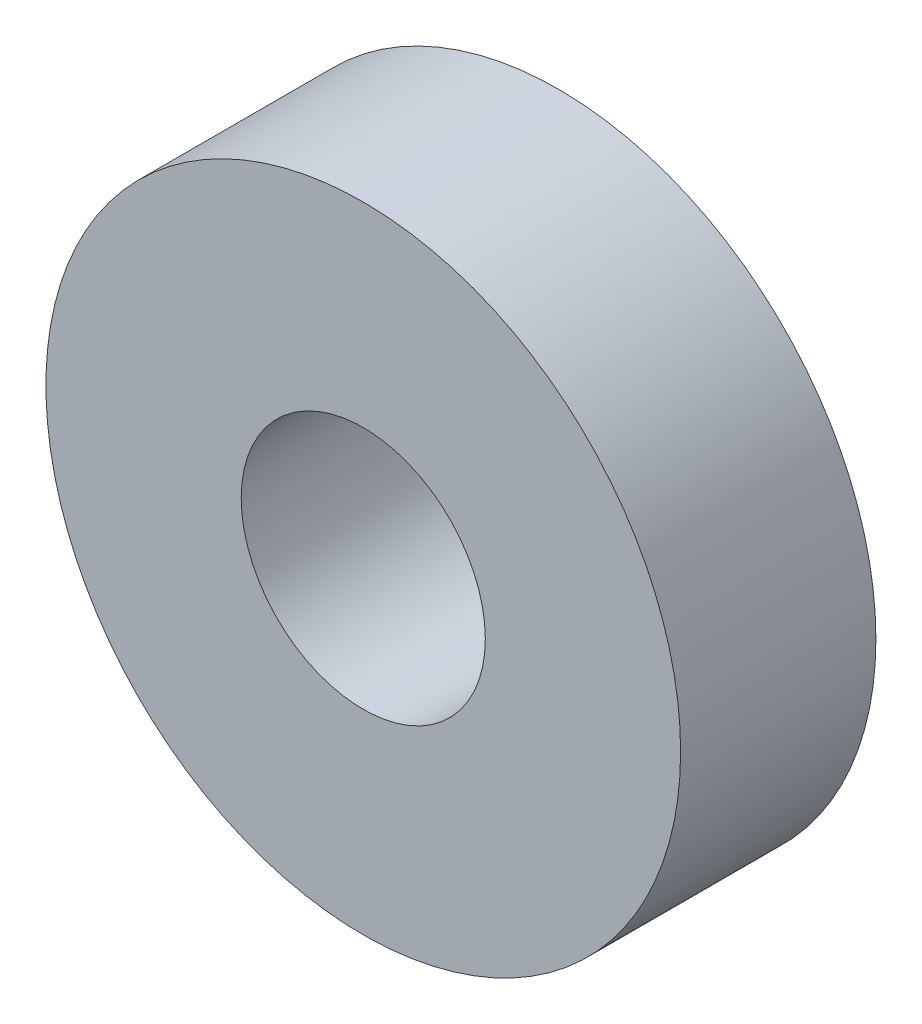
from build123d import *

# Parameters (mm, degrees)
ANILLO_PROFILE_R  = 13
TALADRO_PROFILE_R = 5


with BuildPart() as part:
    # Anillo: sweep along a curve in space
    with BuildLine() as anillo_path:
        Line((-425.1, 65, 50), (-425.1, 65, 58))
    # Anillo profile (on start of the path) → Anillo (sweep)
    with BuildSketch(Plane(origin=(-425.1, 65, 50), x_dir=(1, 0, 0), z_dir=(0, 0, 1))):
        Circle(ANILLO_PROFILE_R)
    sweep(path=anillo_path.line)

    # Taladro: sweep along a curve in space
    with BuildLine() as taladro_path:
        Line((-425.1, 65, 50), (-425.1, 65, 58))
    # Taladro profile (on start of the path) → Taladro (sweep, cut)
    with BuildSketch(Plane(origin=(-425.1, 65, 50), x_dir=(1, 0, 0), z_dir=(0, 0, 1))):
        Circle(TALADRO_PROFILE_R)
    sweep(path=taladro_path.line, mode=Mode.SUBTRACT)


solid = part.part
